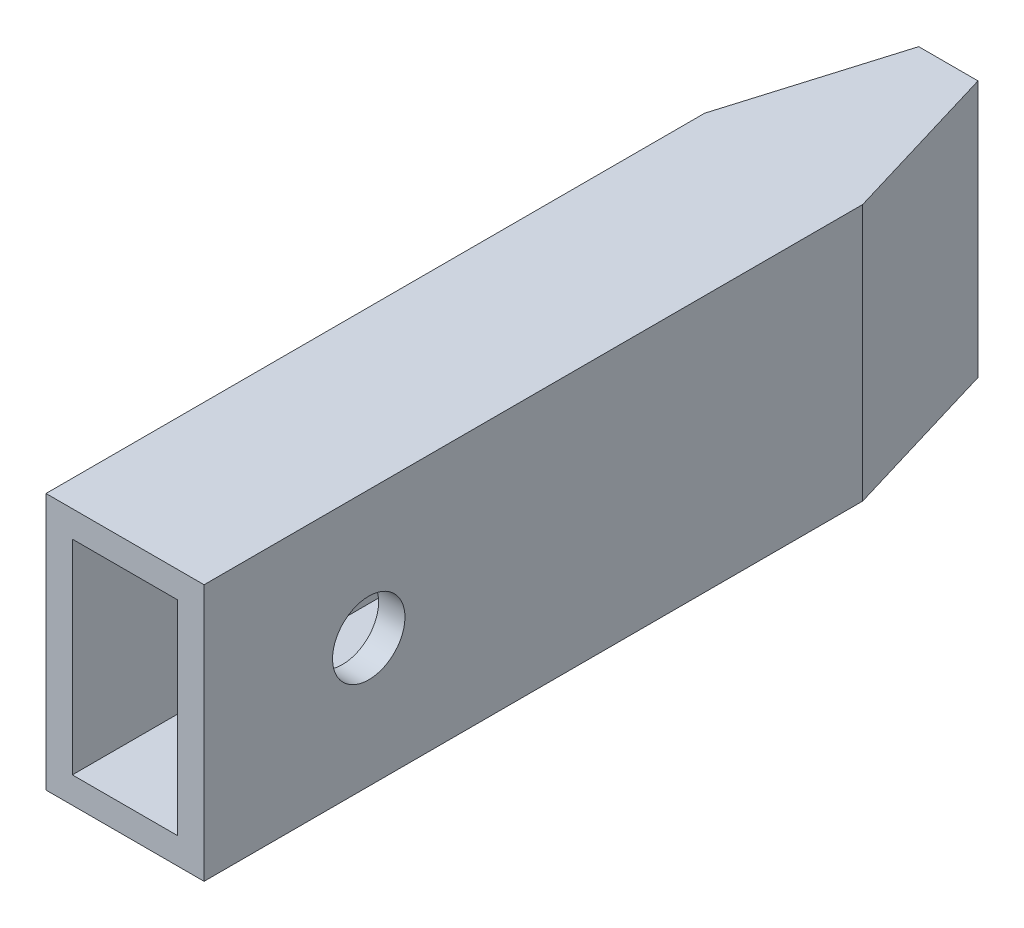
ISO-10303-21;
HEADER;
FILE_DESCRIPTION(('STEP AP214'),'2;1');
FILE_NAME('part.step','',(''),(''),'','','');
FILE_SCHEMA(('AUTOMOTIVE_DESIGN { 1 0 10303 214 1 1 1 1 }'));
ENDSEC;
DATA;
#1=APPLICATION_CONTEXT('core data for automotive mechanical design processes');
#2=APPLICATION_PROTOCOL_DEFINITION('international standard','automotive_design',2000,#1);
#3=PRODUCT_CONTEXT('',#1,'mechanical');
#4=PRODUCT('Part','Part','',(#3));
#5=PRODUCT_RELATED_PRODUCT_CATEGORY('part','',(#4));
#6=PRODUCT_DEFINITION_FORMATION('','',#4);
#7=PRODUCT_DEFINITION_CONTEXT('part definition',#1,'design');
#8=PRODUCT_DEFINITION('design','',#6,#7);
#9=PRODUCT_DEFINITION_SHAPE('','',#8);
#10=(LENGTH_UNIT() NAMED_UNIT(*) SI_UNIT(.MILLI.,.METRE.));
#11=(NAMED_UNIT(*) PLANE_ANGLE_UNIT() SI_UNIT($,.RADIAN.));
#12=(NAMED_UNIT(*) SI_UNIT($,.STERADIAN.) SOLID_ANGLE_UNIT());
#13=UNCERTAINTY_MEASURE_WITH_UNIT(LENGTH_MEASURE(1.E-05),#10,'distance_accuracy_value','');
#14=(GEOMETRIC_REPRESENTATION_CONTEXT(3) GLOBAL_UNCERTAINTY_ASSIGNED_CONTEXT((#13)) GLOBAL_UNIT_ASSIGNED_CONTEXT((#10,
#11,#12)) REPRESENTATION_CONTEXT('',''));
#15=CARTESIAN_POINT('',(0.,0.,0.));
#16=DIRECTION('',(0.,0.,1.));
#17=DIRECTION('',(1.,0.,0.));
#18=AXIS2_PLACEMENT_3D('',#15,#16,#17);
#19=CARTESIAN_POINT('',(0.,0.,20.));
#20=DIRECTION('',(0.,0.,-1.));
#21=DIRECTION('',(-1.,0.,0.));
#22=AXIS2_PLACEMENT_3D('',#19,#20,#21);
#23=PLANE('',#22);
#24=DIRECTION('',(0.,-1.,0.));
#25=VECTOR('',#24,1.);
#26=CARTESIAN_POINT('',(-2.4,-3.9,20.));
#27=LINE('',#26,#25);
#28=CARTESIAN_POINT('',(-2.4,3.9,20.));
#29=VERTEX_POINT('',#28);
#30=CARTESIAN_POINT('',(-2.4,-3.9,20.));
#31=VERTEX_POINT('',#30);
#32=EDGE_CURVE('E166',#29,#31,#27,.T.);
#33=ORIENTED_EDGE('',*,*,#32,.T.);
#34=DIRECTION('',(1.,0.,0.));
#35=VECTOR('',#34,1.);
#36=CARTESIAN_POINT('',(-2.4,-3.9,20.));
#37=LINE('',#36,#35);
#38=CARTESIAN_POINT('',(2.4,-3.9,20.));
#39=VERTEX_POINT('',#38);
#40=EDGE_CURVE('E170',#31,#39,#37,.T.);
#41=ORIENTED_EDGE('',*,*,#40,.T.);
#42=DIRECTION('',(0.,1.,0.));
#43=VECTOR('',#42,1.);
#44=CARTESIAN_POINT('',(2.4,-3.9,20.));
#45=LINE('',#44,#43);
#46=CARTESIAN_POINT('',(2.4,3.9,20.));
#47=VERTEX_POINT('',#46);
#48=EDGE_CURVE('E173',#39,#47,#45,.T.);
#49=ORIENTED_EDGE('',*,*,#48,.T.);
#50=DIRECTION('',(-1.,0.,0.));
#51=VECTOR('',#50,1.);
#52=CARTESIAN_POINT('',(-2.4,3.9,20.));
#53=LINE('',#52,#51);
#54=EDGE_CURVE('E176',#47,#29,#53,.T.);
#55=ORIENTED_EDGE('',*,*,#54,.T.);
#56=EDGE_LOOP('',(#33,#41,#49,#55));
#57=FACE_BOUND('',#56,.T.);
#58=DIRECTION('',(0.,-1.,0.));
#59=VECTOR('',#58,1.);
#60=CARTESIAN_POINT('',(-1.6,-3.1,20.));
#61=LINE('',#60,#59);
#62=CARTESIAN_POINT('',(-1.6,3.1,20.));
#63=VERTEX_POINT('',#62);
#64=CARTESIAN_POINT('',(-1.6,-3.1,20.));
#65=VERTEX_POINT('',#64);
#66=EDGE_CURVE('E134',#63,#65,#61,.T.);
#67=ORIENTED_EDGE('',*,*,#66,.F.);
#68=DIRECTION('',(-1.,0.,0.));
#69=VECTOR('',#68,1.);
#70=CARTESIAN_POINT('',(-1.6,3.1,20.));
#71=LINE('',#70,#69);
#72=CARTESIAN_POINT('',(1.6,3.1,20.));
#73=VERTEX_POINT('',#72);
#74=EDGE_CURVE('E158',#73,#63,#71,.T.);
#75=ORIENTED_EDGE('',*,*,#74,.F.);
#76=DIRECTION('',(0.,1.,0.));
#77=VECTOR('',#76,1.);
#78=CARTESIAN_POINT('',(1.6,-3.1,20.));
#79=LINE('',#78,#77);
#80=CARTESIAN_POINT('',(1.6,-3.1,20.));
#81=VERTEX_POINT('',#80);
#82=EDGE_CURVE('E143',#81,#73,#79,.T.);
#83=ORIENTED_EDGE('',*,*,#82,.F.);
#84=DIRECTION('',(1.,0.,0.));
#85=VECTOR('',#84,1.);
#86=CARTESIAN_POINT('',(-1.6,-3.1,20.));
#87=LINE('',#86,#85);
#88=EDGE_CURVE('E306',#65,#81,#87,.T.);
#89=ORIENTED_EDGE('',*,*,#88,.F.);
#90=EDGE_LOOP('',(#67,#75,#83,#89));
#91=FACE_BOUND('',#90,.T.);
#92=ADVANCED_FACE('F41',(#57,#91),#23,.F.);
#93=CARTESIAN_POINT('',(-2.4,-3.9,20.));
#94=DIRECTION('',(1.,0.,0.));
#95=DIRECTION('',(0.,0.,-1.));
#96=AXIS2_PLACEMENT_3D('',#93,#94,#95);
#97=PLANE('',#96);
#98=CARTESIAN_POINT('',(-2.4,0.,15.));
#99=DIRECTION('',(1.,0.,0.));
#100=DIRECTION('',(0.,0.,-1.));
#101=AXIS2_PLACEMENT_3D('',#98,#99,#100);
#102=CIRCLE('',#101,1.1);
#103=CARTESIAN_POINT('',(-2.4,0.,13.9));
#104=VERTEX_POINT('',#103);
#105=EDGE_CURVE('E224',#104,#104,#102,.T.);
#106=ORIENTED_EDGE('',*,*,#105,.T.);
#107=EDGE_LOOP('',(#106));
#108=FACE_BOUND('',#107,.T.);
#109=DIRECTION('',(0.,0.,-1.));
#110=VECTOR('',#109,1.);
#111=CARTESIAN_POINT('',(-2.4,3.9,20.));
#112=LINE('',#111,#110);
#113=CARTESIAN_POINT('',(-2.4,3.9,0.));
#114=VERTEX_POINT('',#113);
#115=EDGE_CURVE('E179',#29,#114,#112,.T.);
#116=ORIENTED_EDGE('',*,*,#115,.T.);
#117=DIRECTION('',(0.,-1.,0.));
#118=VECTOR('',#117,1.);
#119=CARTESIAN_POINT('',(-2.4,-3.9,0.));
#120=LINE('',#119,#118);
#121=CARTESIAN_POINT('',(-2.4,-3.9,0.));
#122=VERTEX_POINT('',#121);
#123=EDGE_CURVE('E67',#114,#122,#120,.T.);
#124=ORIENTED_EDGE('',*,*,#123,.T.);
#125=DIRECTION('',(0.,0.,-1.));
#126=VECTOR('',#125,1.);
#127=CARTESIAN_POINT('',(-2.4,-3.9,20.));
#128=LINE('',#127,#126);
#129=EDGE_CURVE('E189',#31,#122,#128,.T.);
#130=ORIENTED_EDGE('',*,*,#129,.F.);
#131=ORIENTED_EDGE('',*,*,#32,.F.);
#132=EDGE_LOOP('',(#116,#124,#130,#131));
#133=FACE_BOUND('',#132,.T.);
#134=ADVANCED_FACE('F232',(#108,#133),#97,.F.);
#135=CARTESIAN_POINT('',(-2.4,-3.9,20.));
#136=DIRECTION('',(0.,1.,0.));
#137=DIRECTION('',(0.,0.,1.));
#138=AXIS2_PLACEMENT_3D('',#135,#136,#137);
#139=PLANE('',#138);
#140=ORIENTED_EDGE('',*,*,#129,.T.);
#141=DIRECTION('',(0.287347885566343,0.,-0.957826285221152));
#142=VECTOR('',#141,1.);
#143=CARTESIAN_POINT('',(-0.899999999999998,-3.9,-5.));
#144=LINE('',#143,#142);
#145=CARTESIAN_POINT('',(-0.899999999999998,-3.9,-5.));
#146=VERTEX_POINT('',#145);
#147=EDGE_CURVE('E52',#122,#146,#144,.T.);
#148=ORIENTED_EDGE('',*,*,#147,.T.);
#149=DIRECTION('',(-1.,0.,0.));
#150=VECTOR('',#149,1.);
#151=CARTESIAN_POINT('',(2.4,-3.9,-5.));
#152=LINE('',#151,#150);
#153=CARTESIAN_POINT('',(0.899999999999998,-3.9,-5.));
#154=VERTEX_POINT('',#153);
#155=EDGE_CURVE('E214',#154,#146,#152,.T.);
#156=ORIENTED_EDGE('',*,*,#155,.F.);
#157=DIRECTION('',(0.287347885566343,0.,0.957826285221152));
#158=VECTOR('',#157,1.);
#159=CARTESIAN_POINT('',(0.899999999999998,-3.9,-5.));
#160=LINE('',#159,#158);
#161=CARTESIAN_POINT('',(2.4,-3.9,0.));
#162=VERTEX_POINT('',#161);
#163=EDGE_CURVE('E59',#154,#162,#160,.T.);
#164=ORIENTED_EDGE('',*,*,#163,.T.);
#165=DIRECTION('',(0.,0.,-1.));
#166=VECTOR('',#165,1.);
#167=CARTESIAN_POINT('',(2.4,-3.9,20.));
#168=LINE('',#167,#166);
#169=EDGE_CURVE('E186',#39,#162,#168,.T.);
#170=ORIENTED_EDGE('',*,*,#169,.F.);
#171=ORIENTED_EDGE('',*,*,#40,.F.);
#172=EDGE_LOOP('',(#140,#148,#156,#164,#170,#171));
#173=FACE_BOUND('',#172,.T.);
#174=ADVANCED_FACE('F213',(#173),#139,.F.);
#175=CARTESIAN_POINT('',(2.4,-3.9,20.));
#176=DIRECTION('',(-1.,0.,0.));
#177=DIRECTION('',(0.,-1.,0.));
#178=AXIS2_PLACEMENT_3D('',#175,#176,#177);
#179=PLANE('',#178);
#180=CARTESIAN_POINT('',(2.4,0.,15.));
#181=DIRECTION('',(1.,0.,0.));
#182=DIRECTION('',(0.,1.,0.));
#183=AXIS2_PLACEMENT_3D('',#180,#181,#182);
#184=CIRCLE('',#183,1.1);
#185=CARTESIAN_POINT('',(2.4,1.1,15.));
#186=VERTEX_POINT('',#185);
#187=EDGE_CURVE('E290',#186,#186,#184,.T.);
#188=ORIENTED_EDGE('',*,*,#187,.F.);
#189=EDGE_LOOP('',(#188));
#190=FACE_BOUND('',#189,.T.);
#191=ORIENTED_EDGE('',*,*,#169,.T.);
#192=DIRECTION('',(0.,1.,0.));
#193=VECTOR('',#192,1.);
#194=CARTESIAN_POINT('',(2.4,3.9,0.));
#195=LINE('',#194,#193);
#196=CARTESIAN_POINT('',(2.4,3.9,0.));
#197=VERTEX_POINT('',#196);
#198=EDGE_CURVE('E11',#162,#197,#195,.T.);
#199=ORIENTED_EDGE('',*,*,#198,.T.);
#200=DIRECTION('',(0.,0.,-1.));
#201=VECTOR('',#200,1.);
#202=CARTESIAN_POINT('',(2.4,3.9,20.));
#203=LINE('',#202,#201);
#204=EDGE_CURVE('E182',#47,#197,#203,.T.);
#205=ORIENTED_EDGE('',*,*,#204,.F.);
#206=ORIENTED_EDGE('',*,*,#48,.F.);
#207=EDGE_LOOP('',(#191,#199,#205,#206));
#208=FACE_BOUND('',#207,.T.);
#209=ADVANCED_FACE('F241',(#190,#208),#179,.F.);
#210=CARTESIAN_POINT('',(-2.4,3.9,20.));
#211=DIRECTION('',(0.,-1.,0.));
#212=DIRECTION('',(0.,0.,-1.));
#213=AXIS2_PLACEMENT_3D('',#210,#211,#212);
#214=PLANE('',#213);
#215=DIRECTION('',(1.,0.,0.));
#216=VECTOR('',#215,1.);
#217=CARTESIAN_POINT('',(2.4,3.9,-5.));
#218=LINE('',#217,#216);
#219=CARTESIAN_POINT('',(-0.899999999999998,3.9,-5.));
#220=VERTEX_POINT('',#219);
#221=CARTESIAN_POINT('',(0.899999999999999,3.9,-5.));
#222=VERTEX_POINT('',#221);
#223=EDGE_CURVE('E223',#220,#222,#218,.T.);
#224=ORIENTED_EDGE('',*,*,#223,.F.);
#225=DIRECTION('',(-0.287347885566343,0.,0.957826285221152));
#226=VECTOR('',#225,1.);
#227=CARTESIAN_POINT('',(-0.899999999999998,3.9,-5.));
#228=LINE('',#227,#226);
#229=EDGE_CURVE('E203',#220,#114,#228,.T.);
#230=ORIENTED_EDGE('',*,*,#229,.T.);
#231=ORIENTED_EDGE('',*,*,#115,.F.);
#232=ORIENTED_EDGE('',*,*,#54,.F.);
#233=ORIENTED_EDGE('',*,*,#204,.T.);
#234=DIRECTION('',(-0.287347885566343,0.,-0.957826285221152));
#235=VECTOR('',#234,1.);
#236=CARTESIAN_POINT('',(0.899999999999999,3.9,-5.));
#237=LINE('',#236,#235);
#238=EDGE_CURVE('E200',#197,#222,#237,.T.);
#239=ORIENTED_EDGE('',*,*,#238,.T.);
#240=EDGE_LOOP('',(#224,#230,#231,#232,#233,#239));
#241=FACE_BOUND('',#240,.T.);
#242=ADVANCED_FACE('F229',(#241),#214,.F.);
#243=CARTESIAN_POINT('',(-1.6,-3.1,20.));
#244=DIRECTION('',(1.,0.,0.));
#245=DIRECTION('',(0.,0.,-1.));
#246=AXIS2_PLACEMENT_3D('',#243,#244,#245);
#247=PLANE('',#246);
#248=CARTESIAN_POINT('',(-1.6,0.,15.));
#249=DIRECTION('',(1.,0.,0.));
#250=DIRECTION('',(0.,0.,-1.));
#251=AXIS2_PLACEMENT_3D('',#248,#249,#250);
#252=CIRCLE('',#251,1.1);
#253=CARTESIAN_POINT('',(-1.6,0.,13.9));
#254=VERTEX_POINT('',#253);
#255=EDGE_CURVE('E294',#254,#254,#252,.T.);
#256=ORIENTED_EDGE('',*,*,#255,.F.);
#257=EDGE_LOOP('',(#256));
#258=FACE_BOUND('',#257,.T.);
#259=DIRECTION('',(0.,-1.,0.));
#260=VECTOR('',#259,1.);
#261=CARTESIAN_POINT('',(-1.6,-3.1,0.));
#262=LINE('',#261,#260);
#263=CARTESIAN_POINT('',(-1.6,3.1,0.));
#264=VERTEX_POINT('',#263);
#265=CARTESIAN_POINT('',(-1.6,-3.1,0.));
#266=VERTEX_POINT('',#265);
#267=EDGE_CURVE('E153',#264,#266,#262,.T.);
#268=ORIENTED_EDGE('',*,*,#267,.F.);
#269=DIRECTION('',(0.,0.,-1.));
#270=VECTOR('',#269,1.);
#271=CARTESIAN_POINT('',(-1.6,3.1,20.));
#272=LINE('',#271,#270);
#273=EDGE_CURVE('E129',#63,#264,#272,.T.);
#274=ORIENTED_EDGE('',*,*,#273,.F.);
#275=ORIENTED_EDGE('',*,*,#66,.T.);
#276=DIRECTION('',(0.,0.,-1.));
#277=VECTOR('',#276,1.);
#278=CARTESIAN_POINT('',(-1.6,-3.1,20.));
#279=LINE('',#278,#277);
#280=EDGE_CURVE('E162',#65,#266,#279,.T.);
#281=ORIENTED_EDGE('',*,*,#280,.T.);
#282=EDGE_LOOP('',(#268,#274,#275,#281));
#283=FACE_BOUND('',#282,.T.);
#284=ADVANCED_FACE('F249',(#258,#283),#247,.T.);
#285=CARTESIAN_POINT('',(-1.6,-3.1,20.));
#286=DIRECTION('',(0.,1.,0.));
#287=DIRECTION('',(0.,0.,1.));
#288=AXIS2_PLACEMENT_3D('',#285,#286,#287);
#289=PLANE('',#288);
#290=DIRECTION('',(1.,0.,0.));
#291=VECTOR('',#290,1.);
#292=CARTESIAN_POINT('',(-1.6,-3.1,0.));
#293=LINE('',#292,#291);
#294=CARTESIAN_POINT('',(1.6,-3.1,0.));
#295=VERTEX_POINT('',#294);
#296=EDGE_CURVE('E149',#266,#295,#293,.T.);
#297=ORIENTED_EDGE('',*,*,#296,.F.);
#298=ORIENTED_EDGE('',*,*,#280,.F.);
#299=ORIENTED_EDGE('',*,*,#88,.T.);
#300=DIRECTION('',(0.,0.,-1.));
#301=VECTOR('',#300,1.);
#302=CARTESIAN_POINT('',(1.6,-3.1,20.));
#303=LINE('',#302,#301);
#304=EDGE_CURVE('E146',#81,#295,#303,.T.);
#305=ORIENTED_EDGE('',*,*,#304,.T.);
#306=EDGE_LOOP('',(#297,#298,#299,#305));
#307=FACE_BOUND('',#306,.T.);
#308=ADVANCED_FACE('F263',(#307),#289,.T.);
#309=CARTESIAN_POINT('',(1.6,-3.1,20.));
#310=DIRECTION('',(-1.,0.,0.));
#311=DIRECTION('',(0.,-1.,0.));
#312=AXIS2_PLACEMENT_3D('',#309,#310,#311);
#313=PLANE('',#312);
#314=CARTESIAN_POINT('',(1.6,0.,15.));
#315=DIRECTION('',(-1.,0.,0.));
#316=DIRECTION('',(0.,-1.,0.));
#317=AXIS2_PLACEMENT_3D('',#314,#315,#316);
#318=CIRCLE('',#317,1.1);
#319=CARTESIAN_POINT('',(1.6,-1.1,15.));
#320=VERTEX_POINT('',#319);
#321=EDGE_CURVE('E46',#320,#320,#318,.T.);
#322=ORIENTED_EDGE('',*,*,#321,.F.);
#323=EDGE_LOOP('',(#322));
#324=FACE_BOUND('',#323,.T.);
#325=DIRECTION('',(0.,1.,0.));
#326=VECTOR('',#325,1.);
#327=CARTESIAN_POINT('',(1.6,-3.1,0.));
#328=LINE('',#327,#326);
#329=CARTESIAN_POINT('',(1.6,3.1,0.));
#330=VERTEX_POINT('',#329);
#331=EDGE_CURVE('E135',#295,#330,#328,.T.);
#332=ORIENTED_EDGE('',*,*,#331,.F.);
#333=ORIENTED_EDGE('',*,*,#304,.F.);
#334=ORIENTED_EDGE('',*,*,#82,.T.);
#335=DIRECTION('',(0.,0.,-1.));
#336=VECTOR('',#335,1.);
#337=CARTESIAN_POINT('',(1.6,3.1,20.));
#338=LINE('',#337,#336);
#339=EDGE_CURVE('E126',#73,#330,#338,.T.);
#340=ORIENTED_EDGE('',*,*,#339,.T.);
#341=EDGE_LOOP('',(#332,#333,#334,#340));
#342=FACE_BOUND('',#341,.T.);
#343=ADVANCED_FACE('F139',(#324,#342),#313,.T.);
#344=CARTESIAN_POINT('',(-1.6,3.1,20.));
#345=DIRECTION('',(0.,-1.,0.));
#346=DIRECTION('',(1.,0.,0.));
#347=AXIS2_PLACEMENT_3D('',#344,#345,#346);
#348=PLANE('',#347);
#349=DIRECTION('',(-1.,0.,0.));
#350=VECTOR('',#349,1.);
#351=CARTESIAN_POINT('',(-1.6,3.1,0.));
#352=LINE('',#351,#350);
#353=EDGE_CURVE('E123',#330,#264,#352,.T.);
#354=ORIENTED_EDGE('',*,*,#353,.F.);
#355=ORIENTED_EDGE('',*,*,#339,.F.);
#356=ORIENTED_EDGE('',*,*,#74,.T.);
#357=ORIENTED_EDGE('',*,*,#273,.T.);
#358=EDGE_LOOP('',(#354,#355,#356,#357));
#359=FACE_BOUND('',#358,.T.);
#360=ADVANCED_FACE('F125',(#359),#348,.T.);
#361=CARTESIAN_POINT('',(0.,0.,0.));
#362=DIRECTION('',(0.,0.,-1.));
#363=DIRECTION('',(-1.,0.,0.));
#364=AXIS2_PLACEMENT_3D('',#361,#362,#363);
#365=PLANE('',#364);
#366=ORIENTED_EDGE('',*,*,#331,.T.);
#367=ORIENTED_EDGE('',*,*,#353,.T.);
#368=ORIENTED_EDGE('',*,*,#267,.T.);
#369=ORIENTED_EDGE('',*,*,#296,.T.);
#370=EDGE_LOOP('',(#366,#367,#368,#369));
#371=FACE_BOUND('',#370,.T.);
#372=ADVANCED_FACE('F148',(#371),#365,.F.);
#373=CARTESIAN_POINT('',(0.,0.,-5.));
#374=DIRECTION('',(0.,0.,-1.));
#375=DIRECTION('',(-1.,0.,0.));
#376=AXIS2_PLACEMENT_3D('',#373,#374,#375);
#377=PLANE('',#376);
#378=ORIENTED_EDGE('',*,*,#155,.T.);
#379=DIRECTION('',(0.,1.,0.));
#380=VECTOR('',#379,1.);
#381=CARTESIAN_POINT('',(-0.899999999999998,3.9,-5.));
#382=LINE('',#381,#380);
#383=EDGE_CURVE('E196',#146,#220,#382,.T.);
#384=ORIENTED_EDGE('',*,*,#383,.T.);
#385=ORIENTED_EDGE('',*,*,#223,.T.);
#386=DIRECTION('',(0.,-1.,0.));
#387=VECTOR('',#386,1.);
#388=CARTESIAN_POINT('',(0.899999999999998,-3.9,-5.));
#389=LINE('',#388,#387);
#390=EDGE_CURVE('E192',#222,#154,#389,.T.);
#391=ORIENTED_EDGE('',*,*,#390,.T.);
#392=EDGE_LOOP('',(#378,#384,#385,#391));
#393=FACE_BOUND('',#392,.T.);
#394=ADVANCED_FACE('F218',(#393),#377,.T.);
#395=CARTESIAN_POINT('',(-0.899999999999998,0.,-5.));
#396=DIRECTION('',(-0.957826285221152,0.,-0.287347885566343));
#397=DIRECTION('',(0.,-1.,0.));
#398=AXIS2_PLACEMENT_3D('',#395,#396,#397);
#399=PLANE('',#398);
#400=ORIENTED_EDGE('',*,*,#147,.F.);
#401=ORIENTED_EDGE('',*,*,#123,.F.);
#402=ORIENTED_EDGE('',*,*,#229,.F.);
#403=ORIENTED_EDGE('',*,*,#383,.F.);
#404=EDGE_LOOP('',(#400,#401,#402,#403));
#405=FACE_BOUND('',#404,.T.);
#406=ADVANCED_FACE('F226',(#405),#399,.T.);
#407=CARTESIAN_POINT('',(0.899999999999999,0.,-5.));
#408=DIRECTION('',(0.957826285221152,0.,-0.287347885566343));
#409=DIRECTION('',(0.,1.,0.));
#410=AXIS2_PLACEMENT_3D('',#407,#408,#409);
#411=PLANE('',#410);
#412=ORIENTED_EDGE('',*,*,#238,.F.);
#413=ORIENTED_EDGE('',*,*,#198,.F.);
#414=ORIENTED_EDGE('',*,*,#163,.F.);
#415=ORIENTED_EDGE('',*,*,#390,.F.);
#416=EDGE_LOOP('',(#412,#413,#414,#415));
#417=FACE_BOUND('',#416,.T.);
#418=ADVANCED_FACE('F44',(#417),#411,.T.);
#419=CARTESIAN_POINT('',(-2.6,0.,15.));
#420=DIRECTION('',(1.,0.,0.));
#421=DIRECTION('',(0.,1.,0.));
#422=AXIS2_PLACEMENT_3D('',#419,#420,#421);
#423=CYLINDRICAL_SURFACE('',#422,1.1);
#424=ORIENTED_EDGE('',*,*,#321,.T.);
#425=EDGE_LOOP('',(#424));
#426=FACE_BOUND('',#425,.T.);
#427=ORIENTED_EDGE('',*,*,#187,.T.);
#428=EDGE_LOOP('',(#427));
#429=FACE_BOUND('',#428,.T.);
#430=ADVANCED_FACE('F277',(#426,#429),#423,.F.);
#431=ORIENTED_EDGE('',*,*,#255,.T.);
#432=EDGE_LOOP('',(#431));
#433=FACE_BOUND('',#432,.T.);
#434=ORIENTED_EDGE('',*,*,#105,.F.);
#435=EDGE_LOOP('',(#434));
#436=FACE_BOUND('',#435,.T.);
#437=ADVANCED_FACE('F279',(#433,#436),#423,.F.);
#438=CLOSED_SHELL('',(#92,#134,#174,#209,#242,#284,#308,#343,#360,#372,#394,#406,#418,#430,#437));
#439=MANIFOLD_SOLID_BREP('B2',#438);
#440=ADVANCED_BREP_SHAPE_REPRESENTATION('',(#18,#439),#14);
#441=SHAPE_DEFINITION_REPRESENTATION(#9,#440);
ENDSEC;
END-ISO-10303-21;
